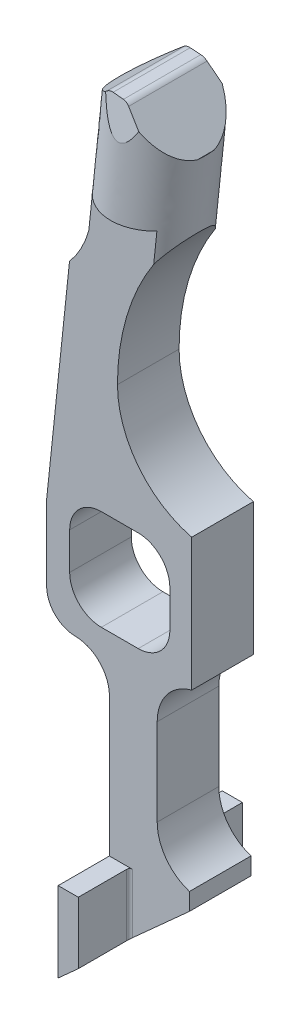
from build123d import *

# Parameters (mm, degrees)
BOSS_EXTRUDE1_DEPTH = 1.3589
BOSS_EXTRUDE2_DEPTH = 3.6195
SKETCH3_R           = 1.9685
BOSS_EXTRUDE3_DEPTH = 7.817304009
CUT_EXTRUDE1_DEPTH  = 7.4295
FILLET1_R           = 0.381
CUT_EXTRUDE2_DEPTH  = 3.094170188
FILLET2_R           = 0.127
CUT_EXTRUDE3_DEPTH  = 11.2395


with BuildPart() as part:
    # Sketch1 → Boss-Extrude1 (new, symmetric)
    with BuildSketch(Plane.XY):
        with BuildLine():
            Line((0, 9.652062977), (0, 0))
            Line((0, 0), (3.5306, 3.178966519))
            Line((3.5306, 3.178966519), (3.5306, 3.940966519))
            ThreePointArc((3.5306, 3.940966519), (2.501949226, 4.677223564), (2.1082, 5.879370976))
            Line((2.1082, 5.879370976), (2.1082, 9.71652446))
            ThreePointArc((2.1082, 9.71652446), (2.533762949, 10.960865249), (3.6322, 11.684))
            Line((3.6322, 11.684), (3.6322, 17.526461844))
            ThreePointArc((3.6322, 17.526461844), (1.271990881, 19.057267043), (0.3556, 21.717))
            ThreePointArc((0.3556, 21.717), (0.580504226, 23.815861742), (1.245004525, 25.819419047))
            Line((1.245004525, 25.819419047), (1.466071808, 28.448))
            Line((1.466071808, 28.448), (-0.7719191, 28.448))
            ThreePointArc((-0.7719191, 28.448), (-0.957374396, 26.810238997), (-1.760251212, 25.370779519))
            Line((-1.760251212, 25.370779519), (-2.7686, 15.77698165))
            Line((-2.7686, 15.77698165), (-2.7686, 12.44594752))
            ThreePointArc((-2.7686, 12.44594752), (-2.400698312, 11.552013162), (-1.510145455, 11.176))
            ThreePointArc((-1.510145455, 11.176), (-0.441482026, 10.724784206), (0, 9.652062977))
        make_face()
        with BuildLine():
            ThreePointArc((-1.7526, 15.113), (-1.343428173, 16.100828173), (-0.3556, 16.51))
            Line((-0.3556, 16.51), (1.27, 16.51))
            ThreePointArc((1.27, 16.51), (2.257828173, 16.100828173), (2.667, 15.113))
            Line((2.667, 15.113), (2.667, 13.4874))
            ThreePointArc((2.667, 13.4874), (2.257828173, 12.499571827), (1.27, 12.0904))
            Line((1.27, 12.0904), (-0.3556, 12.0904))
            ThreePointArc((-0.3556, 12.0904), (-1.343428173, 12.499571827), (-1.7526, 13.4874))
            Line((-1.7526, 13.4874), (-1.7526, 15.113))
        make_face(mode=Mode.SUBTRACT)
    extrude(amount=BOSS_EXTRUDE1_DEPTH, both=True)

    # Sketch2 → Boss-Extrude2 (add, symmetric)
    with BuildSketch(Plane.XY):
        Polygon((0.889, 0.800459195), (0.889, 3.5306), (0, 3.5306), (0, 0), align=None)
    extrude(amount=BOSS_EXTRUDE2_DEPTH, both=True)

    # Sketch3 → Boss-Extrude3 (add, along a direction that is not the sketch's normal)
    with BuildSketch(Plane(origin=(-66.811258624, 25.370779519, 0), x_dir=(1, 0, 0), z_dir=(0, -1, 0))):
        with Locations((67.158334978, 0)):
            Circle(SKETCH3_R)
    extrude(amount=-BOSS_EXTRUDE3_DEPTH, dir=(-0.1045284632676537, -0.9945218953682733, 0))

    # Sketch4 → Cut-Extrude1 (cut, symmetric)
    with BuildSketch(Plane.XY):
        Polygon((-0.590912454, 34.510151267), (0.359777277, 33.145259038), (-1.056042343, 32.070879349), align=None)
        Polygon((1.11909666, 33.08139923), (0.359777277, 33.145259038), (0.359777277, 33.95478235), (4.604654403, 33.95478235), (4.604654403, 31.841109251), (2.880957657, 31.068321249), align=None)
        with BuildLine():
            Line((4.436566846, 30.219057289), (2.625162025, 28.026805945))
            ThreePointArc((2.625162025, 28.026805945), (0.940243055, 25.069781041), (0.3556, 21.717))
            Line((0.3556, 21.717), (4.436566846, 21.717))
            Line((4.436566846, 21.717), (4.436566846, 30.219057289))
        make_face()
    extrude(amount=CUT_EXTRUDE1_DEPTH, both=True, mode=Mode.SUBTRACT)

    # Fillet1
    fillet1_edges = [part.edges().sort_by_distance(p)[0] for p in [
        (1.11909666, 33.08139923, 0),
        (0.359777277, 33.145259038, 0),
    ]]
    fillet(fillet1_edges, radius=FILLET1_R)

    # Sketch5 → Cut-Extrude2 (cut, along a direction that is not the sketch's normal)
    with BuildSketch(Plane.XZ.offset(-25.370779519)):
        with BuildLine():
            Line((1.054063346, 1.3589), (1.954538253, 1.3589))
            add(Edge.make_bspline(
                [(1.954538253, 1.3589), (1.937234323, 1.374047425), (1.919932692, 1.388694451), (1.744546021, 1.532802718), (1.588807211, 1.623101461), (1.30344542, 1.758367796), (1.172166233, 1.803750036), (1.054063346, 1.8371613)],
                knots=[0.736357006, 0.736357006, 0.736357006, 0.736357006, 0.75, 0.75, 0.875, 0.875, 1, 1, 1, 1], degree=3))
            ThreePointArc((1.054063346, 1.8371613), (-0.083953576, 1.920730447), (-1.077136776, 1.3589))
            Line((-1.077136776, 1.3589), (1.054063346, 1.3589))
        make_face()
        with BuildLine():
            add(Edge.make_bspline(
                [(1.054063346, -1.8371613), (1.172499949, -1.803655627), (1.30449128, -1.758076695), (1.592751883, -1.621023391), (1.748540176, -1.530209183), (1.922709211, -1.386334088), (1.938576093, -1.372835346), (1.954444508, -1.3589)],
                knots=[0, 0, 0, 0, 0.125, 0.125, 0.25, 0.25, 0.262503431, 0.262503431, 0.262503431, 0.262503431], degree=3))
            Line((1.954444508, -1.3589), (1.054063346, -1.3589))
            Line((1.054063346, -1.3589), (1.054063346, -1.8371613))
        make_face()
        with BuildLine():
            Line((1.054063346, -1.3589), (0.3556, -1.3589))
            Line((0.3556, -1.3589), (-1.077136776, -1.3589))
            ThreePointArc((-1.077136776, -1.3589), (-0.083953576, -1.920730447), (1.054063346, -1.8371613))
            Line((1.054063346, -1.8371613), (1.054063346, -1.3589))
        make_face()
    extrude(amount=-CUT_EXTRUDE2_DEPTH, dir=(-0.1045284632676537, -0.9945218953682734, 0), mode=Mode.SUBTRACT)

    # Fillet2
    fillet2_edges = [part.edges().sort_by_distance(p)[0] for p in [
        (0.889, 2.165529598, -1.3589),
        (0.889, 2.165529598, 1.3589),
    ]]
    fillet(fillet2_edges, radius=FILLET2_R)

    # Sketch6 → Cut-Extrude3 (cut, symmetric)
    with BuildSketch(Plane(origin=(1.105521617, 0, 0), x_dir=(0, 0, -1), z_dir=(1, 0, 0))):
        Polygon((-1.9685, 31.609002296), (-1.576746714, 33.830745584), (-2.18174766, 33.830745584), (-2.18174766, 30.399614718), align=None)
        Polygon((2.18174766, 30.399614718), (1.9685, 31.609002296), (1.576746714, 33.830745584), (2.18174766, 33.830745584), align=None)
    extrude(amount=CUT_EXTRUDE3_DEPTH, both=True, mode=Mode.SUBTRACT)


solid = part.part
